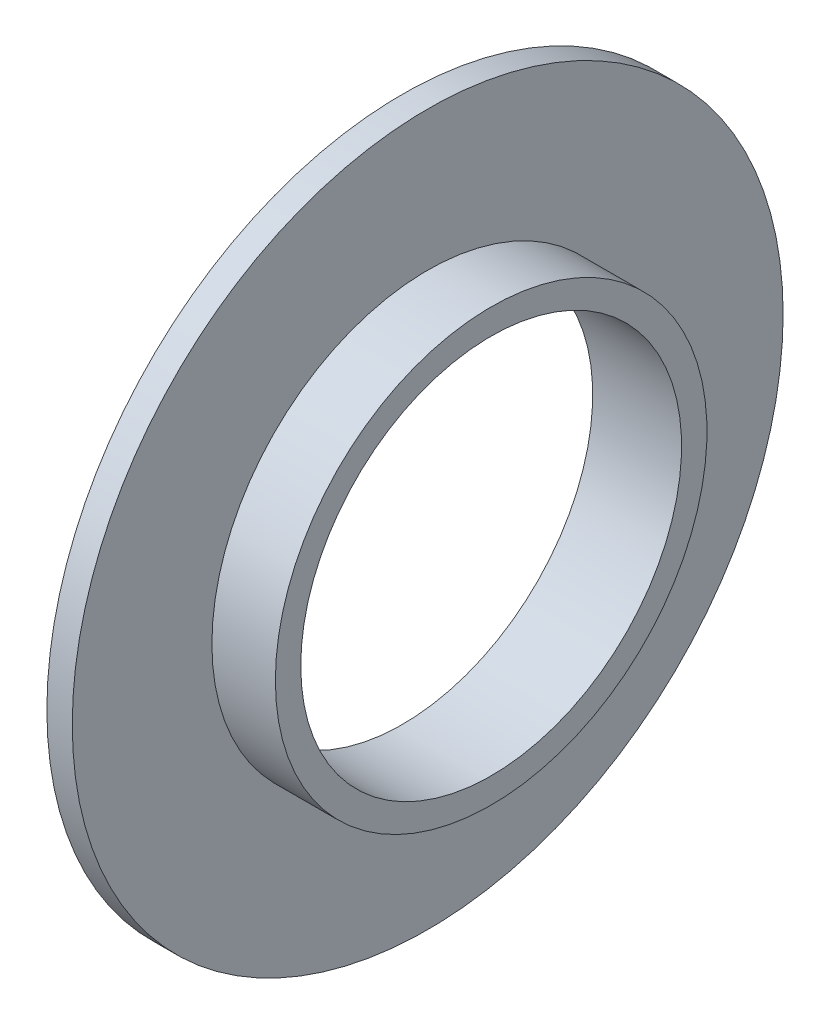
ISO-10303-21;
HEADER;
FILE_DESCRIPTION(('STEP AP214'),'2;1');
FILE_NAME('part.step','',(''),(''),'','','');
FILE_SCHEMA(('AUTOMOTIVE_DESIGN { 1 0 10303 214 1 1 1 1 }'));
ENDSEC;
DATA;
#1=APPLICATION_CONTEXT('core data for automotive mechanical design processes');
#2=APPLICATION_PROTOCOL_DEFINITION('international standard','automotive_design',2000,#1);
#3=PRODUCT_CONTEXT('',#1,'mechanical');
#4=PRODUCT('Part','Part','',(#3));
#5=PRODUCT_RELATED_PRODUCT_CATEGORY('part','',(#4));
#6=PRODUCT_DEFINITION_FORMATION('','',#4);
#7=PRODUCT_DEFINITION_CONTEXT('part definition',#1,'design');
#8=PRODUCT_DEFINITION('design','',#6,#7);
#9=PRODUCT_DEFINITION_SHAPE('','',#8);
#10=(LENGTH_UNIT() NAMED_UNIT(*) SI_UNIT(.MILLI.,.METRE.));
#11=(NAMED_UNIT(*) PLANE_ANGLE_UNIT() SI_UNIT($,.RADIAN.));
#12=(NAMED_UNIT(*) SI_UNIT($,.STERADIAN.) SOLID_ANGLE_UNIT());
#13=UNCERTAINTY_MEASURE_WITH_UNIT(LENGTH_MEASURE(1.E-05),#10,'distance_accuracy_value','');
#14=(GEOMETRIC_REPRESENTATION_CONTEXT(3) GLOBAL_UNCERTAINTY_ASSIGNED_CONTEXT((#13)) GLOBAL_UNIT_ASSIGNED_CONTEXT((#10,
#11,#12)) REPRESENTATION_CONTEXT('',''));
#15=CARTESIAN_POINT('',(0.,0.,0.));
#16=DIRECTION('',(0.,0.,1.));
#17=DIRECTION('',(1.,0.,0.));
#18=AXIS2_PLACEMENT_3D('',#15,#16,#17);
#19=CARTESIAN_POINT('',(-8.2377049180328,0.,0.));
#20=DIRECTION('',(-1.,0.,0.));
#21=DIRECTION('',(0.,0.,1.));
#22=AXIS2_PLACEMENT_3D('',#19,#20,#21);
#23=CYLINDRICAL_SURFACE('',#22,7.5);
#24=CARTESIAN_POINT('',(-0.311475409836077,0.,0.));
#25=DIRECTION('',(-1.,0.,0.));
#26=DIRECTION('',(0.,0.,1.));
#27=AXIS2_PLACEMENT_3D('',#24,#25,#26);
#28=CIRCLE('',#27,7.5);
#29=CARTESIAN_POINT('',(-0.311475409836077,0.,7.5));
#30=VERTEX_POINT('',#29);
#31=EDGE_CURVE('E10',#30,#30,#28,.T.);
#32=ORIENTED_EDGE('',*,*,#31,.F.);
#33=EDGE_LOOP('',(#32));
#34=FACE_BOUND('',#33,.T.);
#35=CARTESIAN_POINT('',(-3.81147540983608,0.,0.));
#36=DIRECTION('',(-1.,0.,0.));
#37=DIRECTION('',(0.,0.,1.));
#38=AXIS2_PLACEMENT_3D('',#35,#36,#37);
#39=CIRCLE('',#38,7.5);
#40=CARTESIAN_POINT('',(-3.81147540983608,0.,7.5));
#41=VERTEX_POINT('',#40);
#42=EDGE_CURVE('E54',#41,#41,#39,.T.);
#43=ORIENTED_EDGE('',*,*,#42,.T.);
#44=EDGE_LOOP('',(#43));
#45=FACE_BOUND('',#44,.T.);
#46=ADVANCED_FACE('F32',(#34,#45),#23,.F.);
#47=CARTESIAN_POINT('',(-0.311475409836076,0.,-8.5));
#48=DIRECTION('',(-1.,0.,0.));
#49=DIRECTION('',(0.,0.,1.));
#50=AXIS2_PLACEMENT_3D('',#47,#48,#49);
#51=PLANE('',#50);
#52=CARTESIAN_POINT('',(-0.311475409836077,0.,0.));
#53=DIRECTION('',(-1.,0.,0.));
#54=DIRECTION('',(0.,0.,1.));
#55=AXIS2_PLACEMENT_3D('',#52,#53,#54);
#56=CIRCLE('',#55,8.5);
#57=CARTESIAN_POINT('',(-0.311475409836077,0.,8.5));
#58=VERTEX_POINT('',#57);
#59=EDGE_CURVE('E38',#58,#58,#56,.T.);
#60=ORIENTED_EDGE('',*,*,#59,.F.);
#61=EDGE_LOOP('',(#60));
#62=FACE_BOUND('',#61,.T.);
#63=ORIENTED_EDGE('',*,*,#31,.T.);
#64=EDGE_LOOP('',(#63));
#65=FACE_BOUND('',#64,.T.);
#66=ADVANCED_FACE('F79',(#62,#65),#51,.F.);
#67=CARTESIAN_POINT('',(-8.2377049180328,0.,0.));
#68=DIRECTION('',(-1.,0.,0.));
#69=DIRECTION('',(0.,0.,1.));
#70=AXIS2_PLACEMENT_3D('',#67,#68,#69);
#71=CYLINDRICAL_SURFACE('',#70,8.5);
#72=CARTESIAN_POINT('',(-2.81147540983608,0.,0.));
#73=DIRECTION('',(-1.,0.,0.));
#74=DIRECTION('',(0.,0.,1.));
#75=AXIS2_PLACEMENT_3D('',#72,#73,#74);
#76=CIRCLE('',#75,8.5);
#77=CARTESIAN_POINT('',(-2.81147540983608,0.,8.5));
#78=VERTEX_POINT('',#77);
#79=EDGE_CURVE('E42',#78,#78,#76,.T.);
#80=ORIENTED_EDGE('',*,*,#79,.F.);
#81=EDGE_LOOP('',(#80));
#82=FACE_BOUND('',#81,.T.);
#83=ORIENTED_EDGE('',*,*,#59,.T.);
#84=EDGE_LOOP('',(#83));
#85=FACE_BOUND('',#84,.T.);
#86=ADVANCED_FACE('F74',(#82,#85),#71,.T.);
#87=CARTESIAN_POINT('',(-2.81147540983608,0.,-8.5));
#88=DIRECTION('',(-1.,0.,0.));
#89=DIRECTION('',(0.,0.,1.));
#90=AXIS2_PLACEMENT_3D('',#87,#88,#89);
#91=PLANE('',#90);
#92=CARTESIAN_POINT('',(-2.81147540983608,0.,0.));
#93=DIRECTION('',(-1.,0.,0.));
#94=DIRECTION('',(0.,0.,1.));
#95=AXIS2_PLACEMENT_3D('',#92,#93,#94);
#96=CIRCLE('',#95,14.);
#97=CARTESIAN_POINT('',(-2.81147540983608,0.,14.));
#98=VERTEX_POINT('',#97);
#99=EDGE_CURVE('E46',#98,#98,#96,.T.);
#100=ORIENTED_EDGE('',*,*,#99,.F.);
#101=EDGE_LOOP('',(#100));
#102=FACE_BOUND('',#101,.T.);
#103=ORIENTED_EDGE('',*,*,#79,.T.);
#104=EDGE_LOOP('',(#103));
#105=FACE_BOUND('',#104,.T.);
#106=ADVANCED_FACE('F68',(#102,#105),#91,.F.);
#107=CARTESIAN_POINT('',(-8.2377049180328,0.,0.));
#108=DIRECTION('',(-1.,0.,0.));
#109=DIRECTION('',(0.,0.,1.));
#110=AXIS2_PLACEMENT_3D('',#107,#108,#109);
#111=CYLINDRICAL_SURFACE('',#110,14.);
#112=CARTESIAN_POINT('',(-3.81147540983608,0.,0.));
#113=DIRECTION('',(-1.,0.,0.));
#114=DIRECTION('',(0.,0.,1.));
#115=AXIS2_PLACEMENT_3D('',#112,#113,#114);
#116=CIRCLE('',#115,14.);
#117=CARTESIAN_POINT('',(-3.81147540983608,0.,14.));
#118=VERTEX_POINT('',#117);
#119=EDGE_CURVE('E51',#118,#118,#116,.T.);
#120=ORIENTED_EDGE('',*,*,#119,.F.);
#121=EDGE_LOOP('',(#120));
#122=FACE_BOUND('',#121,.T.);
#123=ORIENTED_EDGE('',*,*,#99,.T.);
#124=EDGE_LOOP('',(#123));
#125=FACE_BOUND('',#124,.T.);
#126=ADVANCED_FACE('F62',(#122,#125),#111,.T.);
#127=CARTESIAN_POINT('',(-3.81147540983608,0.,-14.));
#128=DIRECTION('',(1.,0.,0.));
#129=DIRECTION('',(0.,0.,-1.));
#130=AXIS2_PLACEMENT_3D('',#127,#128,#129);
#131=PLANE('',#130);
#132=ORIENTED_EDGE('',*,*,#42,.F.);
#133=EDGE_LOOP('',(#132));
#134=FACE_BOUND('',#133,.T.);
#135=ORIENTED_EDGE('',*,*,#119,.T.);
#136=EDGE_LOOP('',(#135));
#137=FACE_BOUND('',#136,.T.);
#138=ADVANCED_FACE('F59',(#134,#137),#131,.F.);
#139=CLOSED_SHELL('',(#46,#66,#86,#106,#126,#138));
#140=MANIFOLD_SOLID_BREP('B2',#139);
#141=ADVANCED_BREP_SHAPE_REPRESENTATION('',(#18,#140),#14);
#142=SHAPE_DEFINITION_REPRESENTATION(#9,#141);
ENDSEC;
END-ISO-10303-21;
